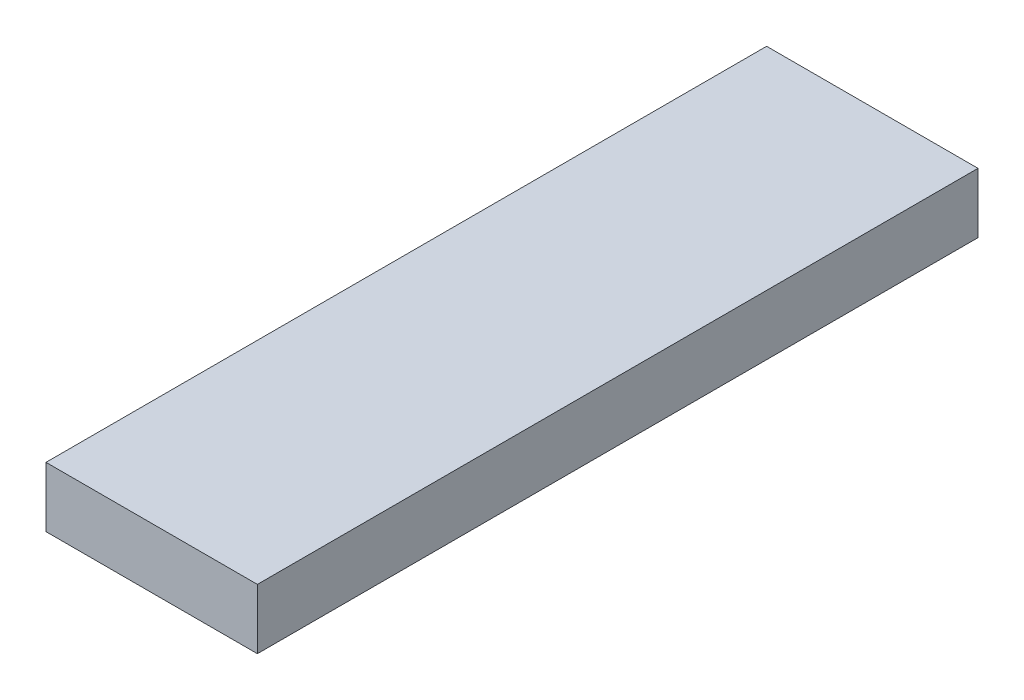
ISO-10303-21;
HEADER;
FILE_DESCRIPTION(('STEP AP214'),'2;1');
FILE_NAME('part.step','',(''),(''),'','','');
FILE_SCHEMA(('AUTOMOTIVE_DESIGN { 1 0 10303 214 1 1 1 1 }'));
ENDSEC;
DATA;
#1=APPLICATION_CONTEXT('core data for automotive mechanical design processes');
#2=APPLICATION_PROTOCOL_DEFINITION('international standard','automotive_design',2000,#1);
#3=PRODUCT_CONTEXT('',#1,'mechanical');
#4=PRODUCT('Part','Part','',(#3));
#5=PRODUCT_RELATED_PRODUCT_CATEGORY('part','',(#4));
#6=PRODUCT_DEFINITION_FORMATION('','',#4);
#7=PRODUCT_DEFINITION_CONTEXT('part definition',#1,'design');
#8=PRODUCT_DEFINITION('design','',#6,#7);
#9=PRODUCT_DEFINITION_SHAPE('','',#8);
#10=(LENGTH_UNIT() NAMED_UNIT(*) SI_UNIT(.MILLI.,.METRE.));
#11=(NAMED_UNIT(*) PLANE_ANGLE_UNIT() SI_UNIT($,.RADIAN.));
#12=(NAMED_UNIT(*) SI_UNIT($,.STERADIAN.) SOLID_ANGLE_UNIT());
#13=UNCERTAINTY_MEASURE_WITH_UNIT(LENGTH_MEASURE(1.E-05),#10,'distance_accuracy_value','');
#14=(GEOMETRIC_REPRESENTATION_CONTEXT(3) GLOBAL_UNCERTAINTY_ASSIGNED_CONTEXT((#13)) GLOBAL_UNIT_ASSIGNED_CONTEXT((#10,
#11,#12)) REPRESENTATION_CONTEXT('',''));
#15=CARTESIAN_POINT('',(0.,0.,0.));
#16=DIRECTION('',(0.,0.,1.));
#17=DIRECTION('',(1.,0.,0.));
#18=AXIS2_PLACEMENT_3D('',#15,#16,#17);
#19=CARTESIAN_POINT('',(0.,12.5,0.));
#20=DIRECTION('',(1.,0.,0.));
#21=DIRECTION('',(0.,0.,-1.));
#22=AXIS2_PLACEMENT_3D('',#19,#20,#21);
#23=PLANE('',#22);
#24=DIRECTION('',(0.,0.,1.));
#25=VECTOR('',#24,1.);
#26=CARTESIAN_POINT('',(0.,0.,0.));
#27=LINE('',#26,#25);
#28=CARTESIAN_POINT('',(0.,0.,-150.));
#29=VERTEX_POINT('',#28);
#30=CARTESIAN_POINT('',(0.,0.,0.));
#31=VERTEX_POINT('',#30);
#32=EDGE_CURVE('E96',#29,#31,#27,.T.);
#33=ORIENTED_EDGE('',*,*,#32,.T.);
#34=DIRECTION('',(0.,-1.,0.));
#35=VECTOR('',#34,1.);
#36=CARTESIAN_POINT('',(0.,12.5,0.));
#37=LINE('',#36,#35);
#38=CARTESIAN_POINT('',(0.,12.5,0.));
#39=VERTEX_POINT('',#38);
#40=EDGE_CURVE('E11',#39,#31,#37,.T.);
#41=ORIENTED_EDGE('',*,*,#40,.F.);
#42=DIRECTION('',(0.,0.,1.));
#43=VECTOR('',#42,1.);
#44=CARTESIAN_POINT('',(0.,12.5,0.));
#45=LINE('',#44,#43);
#46=CARTESIAN_POINT('',(0.,12.5,-150.));
#47=VERTEX_POINT('',#46);
#48=EDGE_CURVE('E84',#47,#39,#45,.T.);
#49=ORIENTED_EDGE('',*,*,#48,.F.);
#50=DIRECTION('',(0.,-1.,0.));
#51=VECTOR('',#50,1.);
#52=CARTESIAN_POINT('',(0.,12.5,-150.));
#53=LINE('',#52,#51);
#54=EDGE_CURVE('E92',#47,#29,#53,.T.);
#55=ORIENTED_EDGE('',*,*,#54,.T.);
#56=EDGE_LOOP('',(#33,#41,#49,#55));
#57=FACE_BOUND('',#56,.T.);
#58=ADVANCED_FACE('F33',(#57),#23,.F.);
#59=CARTESIAN_POINT('',(0.,12.5,0.));
#60=DIRECTION('',(0.,0.,-1.));
#61=DIRECTION('',(-1.,0.,0.));
#62=AXIS2_PLACEMENT_3D('',#59,#60,#61);
#63=PLANE('',#62);
#64=DIRECTION('',(1.,0.,0.));
#65=VECTOR('',#64,1.);
#66=CARTESIAN_POINT('',(0.,0.,0.));
#67=LINE('',#66,#65);
#68=CARTESIAN_POINT('',(44.,0.,0.));
#69=VERTEX_POINT('',#68);
#70=EDGE_CURVE('E88',#31,#69,#67,.T.);
#71=ORIENTED_EDGE('',*,*,#70,.T.);
#72=DIRECTION('',(0.,-1.,0.));
#73=VECTOR('',#72,1.);
#74=CARTESIAN_POINT('',(44.,12.5,0.));
#75=LINE('',#74,#73);
#76=CARTESIAN_POINT('',(44.,12.5,0.));
#77=VERTEX_POINT('',#76);
#78=EDGE_CURVE('E41',#77,#69,#75,.T.);
#79=ORIENTED_EDGE('',*,*,#78,.F.);
#80=DIRECTION('',(1.,0.,0.));
#81=VECTOR('',#80,1.);
#82=CARTESIAN_POINT('',(0.,12.5,0.));
#83=LINE('',#82,#81);
#84=EDGE_CURVE('E79',#39,#77,#83,.T.);
#85=ORIENTED_EDGE('',*,*,#84,.F.);
#86=ORIENTED_EDGE('',*,*,#40,.T.);
#87=EDGE_LOOP('',(#71,#79,#85,#86));
#88=FACE_BOUND('',#87,.T.);
#89=ADVANCED_FACE('F87',(#88),#63,.F.);
#90=CARTESIAN_POINT('',(44.,12.5,0.));
#91=DIRECTION('',(-1.,0.,0.));
#92=DIRECTION('',(0.,0.,1.));
#93=AXIS2_PLACEMENT_3D('',#90,#91,#92);
#94=PLANE('',#93);
#95=DIRECTION('',(0.,0.,-1.));
#96=VECTOR('',#95,1.);
#97=CARTESIAN_POINT('',(44.,0.,0.));
#98=LINE('',#97,#96);
#99=CARTESIAN_POINT('',(44.,0.,-150.));
#100=VERTEX_POINT('',#99);
#101=EDGE_CURVE('E66',#69,#100,#98,.T.);
#102=ORIENTED_EDGE('',*,*,#101,.T.);
#103=DIRECTION('',(0.,-1.,0.));
#104=VECTOR('',#103,1.);
#105=CARTESIAN_POINT('',(44.,12.5,-150.));
#106=LINE('',#105,#104);
#107=CARTESIAN_POINT('',(44.,12.5,-150.));
#108=VERTEX_POINT('',#107);
#109=EDGE_CURVE('E89',#108,#100,#106,.T.);
#110=ORIENTED_EDGE('',*,*,#109,.F.);
#111=DIRECTION('',(0.,0.,-1.));
#112=VECTOR('',#111,1.);
#113=CARTESIAN_POINT('',(44.,12.5,0.));
#114=LINE('',#113,#112);
#115=EDGE_CURVE('E82',#77,#108,#114,.T.);
#116=ORIENTED_EDGE('',*,*,#115,.F.);
#117=ORIENTED_EDGE('',*,*,#78,.T.);
#118=EDGE_LOOP('',(#102,#110,#116,#117));
#119=FACE_BOUND('',#118,.T.);
#120=ADVANCED_FACE('F90',(#119),#94,.F.);
#121=CARTESIAN_POINT('',(0.,12.5,-150.));
#122=DIRECTION('',(0.,0.,1.));
#123=DIRECTION('',(1.,0.,0.));
#124=AXIS2_PLACEMENT_3D('',#121,#122,#123);
#125=PLANE('',#124);
#126=DIRECTION('',(-1.,0.,0.));
#127=VECTOR('',#126,1.);
#128=CARTESIAN_POINT('',(0.,0.,-150.));
#129=LINE('',#128,#127);
#130=EDGE_CURVE('E72',#100,#29,#129,.T.);
#131=ORIENTED_EDGE('',*,*,#130,.T.);
#132=ORIENTED_EDGE('',*,*,#54,.F.);
#133=DIRECTION('',(-1.,0.,0.));
#134=VECTOR('',#133,1.);
#135=CARTESIAN_POINT('',(0.,12.5,-150.));
#136=LINE('',#135,#134);
#137=EDGE_CURVE('E49',#108,#47,#136,.T.);
#138=ORIENTED_EDGE('',*,*,#137,.F.);
#139=ORIENTED_EDGE('',*,*,#109,.T.);
#140=EDGE_LOOP('',(#131,#132,#138,#139));
#141=FACE_BOUND('',#140,.T.);
#142=ADVANCED_FACE('F103',(#141),#125,.F.);
#143=CARTESIAN_POINT('',(0.,12.5,0.));
#144=DIRECTION('',(0.,-1.,0.));
#145=DIRECTION('',(0.,0.,-1.));
#146=AXIS2_PLACEMENT_3D('',#143,#144,#145);
#147=PLANE('',#146);
#148=ORIENTED_EDGE('',*,*,#48,.T.);
#149=ORIENTED_EDGE('',*,*,#84,.T.);
#150=ORIENTED_EDGE('',*,*,#115,.T.);
#151=ORIENTED_EDGE('',*,*,#137,.T.);
#152=EDGE_LOOP('',(#148,#149,#150,#151));
#153=FACE_BOUND('',#152,.T.);
#154=ADVANCED_FACE('F80',(#153),#147,.F.);
#155=CARTESIAN_POINT('',(0.,0.,0.));
#156=DIRECTION('',(0.,-1.,0.));
#157=DIRECTION('',(0.,0.,-1.));
#158=AXIS2_PLACEMENT_3D('',#155,#156,#157);
#159=PLANE('',#158);
#160=ORIENTED_EDGE('',*,*,#32,.F.);
#161=ORIENTED_EDGE('',*,*,#130,.F.);
#162=ORIENTED_EDGE('',*,*,#101,.F.);
#163=ORIENTED_EDGE('',*,*,#70,.F.);
#164=EDGE_LOOP('',(#160,#161,#162,#163));
#165=FACE_BOUND('',#164,.T.);
#166=ADVANCED_FACE('F106',(#165),#159,.T.);
#167=CLOSED_SHELL('',(#58,#89,#120,#142,#154,#166));
#168=MANIFOLD_SOLID_BREP('B2',#167);
#169=ADVANCED_BREP_SHAPE_REPRESENTATION('',(#18,#168),#14);
#170=SHAPE_DEFINITION_REPRESENTATION(#9,#169);
ENDSEC;
END-ISO-10303-21;
